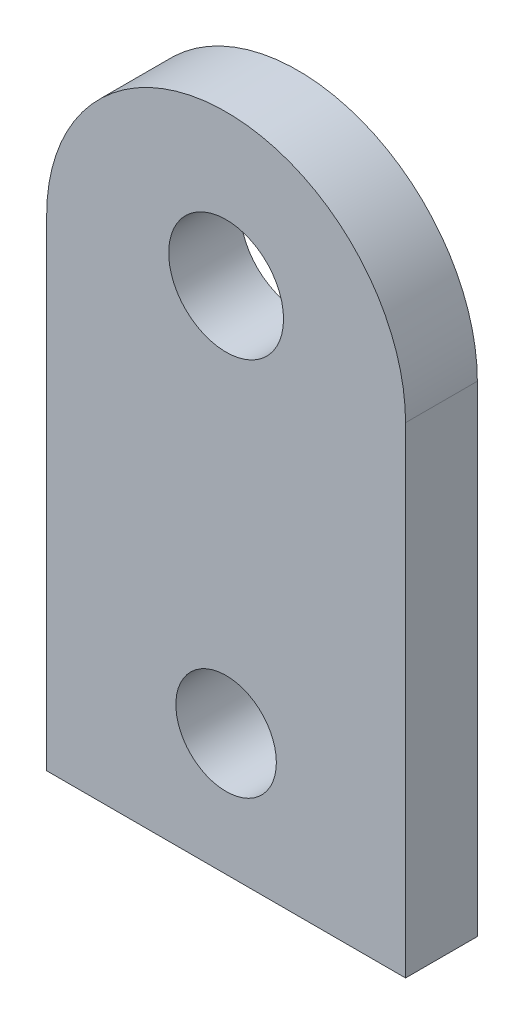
from build123d import *

# Parameters (mm, degrees)
BOSS_EXTRU_1_DEPTH            = 5
DIAM_TRE_DU_PER_AGE_8_0_8_1_D = 8
ESQUISSE4_R                   = 3.5
ENL_V_MAT_EXTRU_1_DEPTH       = 48.929635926


with BuildPart() as part:
    # Esquisse1 → Boss.-Extru.1 (new body)
    with BuildSketch(Plane.XY):
        with BuildLine():
            Line((-12.5, 0), (12.5, 0))
            Line((12.5, 0), (12.5, 33.5))
            ThreePointArc((12.5, 33.5), (0, 46), (-12.5, 33.5))
            Line((-12.5, 33.5), (-12.5, 0))
        make_face()
    extrude(amount=BOSS_EXTRU_1_DEPTH)

    # Diam_tre du per_age _8.0 _8_1 (through all)
    with Locations(Plane.XY.offset(5)):
        with Locations((0, 35.5)):
            Hole(DIAM_TRE_DU_PER_AGE_8_0_8_1_D / 2)

    # Esquisse4 → Enl_v. mat.-Extru.1 (cut, through all)
    with BuildSketch(Plane.XY.offset(5)):
        with Locations((0, 8.5)):
            Circle(ESQUISSE4_R)
    extrude(amount=-ENL_V_MAT_EXTRU_1_DEPTH, mode=Mode.SUBTRACT)


solid = part.part
